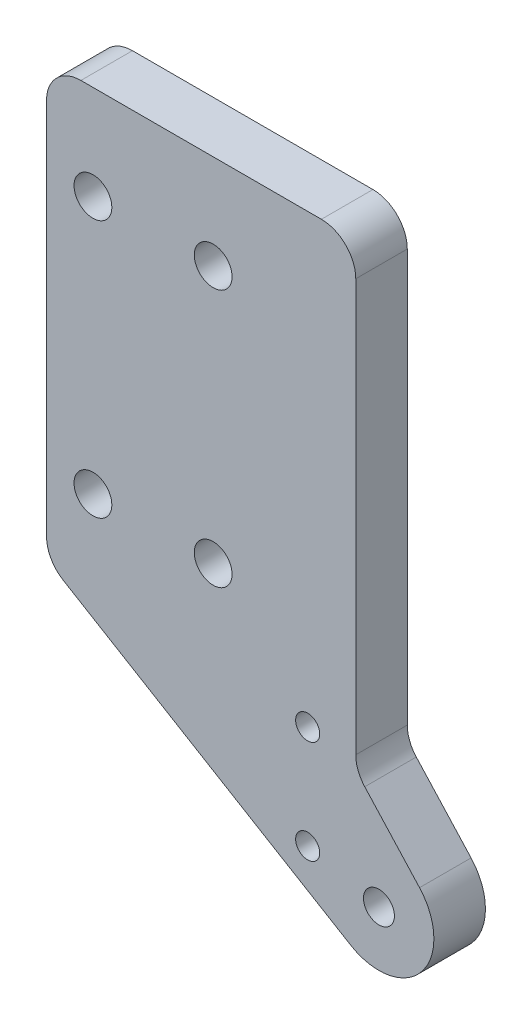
ISO-10303-21;
HEADER;
FILE_DESCRIPTION(('STEP AP214'),'2;1');
FILE_NAME('part.step','',(''),(''),'','','');
FILE_SCHEMA(('AUTOMOTIVE_DESIGN { 1 0 10303 214 1 1 1 1 }'));
ENDSEC;
DATA;
#1=APPLICATION_CONTEXT('core data for automotive mechanical design processes');
#2=APPLICATION_PROTOCOL_DEFINITION('international standard','automotive_design',2000,#1);
#3=PRODUCT_CONTEXT('',#1,'mechanical');
#4=PRODUCT('Part','Part','',(#3));
#5=PRODUCT_RELATED_PRODUCT_CATEGORY('part','',(#4));
#6=PRODUCT_DEFINITION_FORMATION('','',#4);
#7=PRODUCT_DEFINITION_CONTEXT('part definition',#1,'design');
#8=PRODUCT_DEFINITION('design','',#6,#7);
#9=PRODUCT_DEFINITION_SHAPE('','',#8);
#10=(LENGTH_UNIT() NAMED_UNIT(*) SI_UNIT(.MILLI.,.METRE.));
#11=(NAMED_UNIT(*) PLANE_ANGLE_UNIT() SI_UNIT($,.RADIAN.));
#12=(NAMED_UNIT(*) SI_UNIT($,.STERADIAN.) SOLID_ANGLE_UNIT());
#13=UNCERTAINTY_MEASURE_WITH_UNIT(LENGTH_MEASURE(1.E-05),#10,'distance_accuracy_value','');
#14=(GEOMETRIC_REPRESENTATION_CONTEXT(3) GLOBAL_UNCERTAINTY_ASSIGNED_CONTEXT((#13)) GLOBAL_UNIT_ASSIGNED_CONTEXT((#10,
#11,#12)) REPRESENTATION_CONTEXT('',''));
#15=CARTESIAN_POINT('',(0.,0.,0.));
#16=DIRECTION('',(0.,0.,1.));
#17=DIRECTION('',(1.,0.,0.));
#18=AXIS2_PLACEMENT_3D('',#15,#16,#17);
#19=CARTESIAN_POINT('',(0.,0.,5.));
#20=DIRECTION('',(0.,0.,-1.));
#21=DIRECTION('',(-1.,0.,0.));
#22=AXIS2_PLACEMENT_3D('',#19,#20,#21);
#23=CYLINDRICAL_SURFACE('',#22,29.5);
#24=CARTESIAN_POINT('',(0.,0.,2.00000000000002));
#25=DIRECTION('',(0.,0.,1.));
#26=DIRECTION('',(1.,0.,0.));
#27=AXIS2_PLACEMENT_3D('',#24,#25,#26);
#28=CIRCLE('',#27,29.5);
#29=CARTESIAN_POINT('',(29.5,0.,2.00000000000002));
#30=VERTEX_POINT('',#29);
#31=EDGE_CURVE('E43',#30,#30,#28,.T.);
#32=ORIENTED_EDGE('',*,*,#31,.T.);
#33=EDGE_LOOP('',(#32));
#34=FACE_BOUND('',#33,.T.);
#35=CARTESIAN_POINT('',(0.,0.,5.));
#36=DIRECTION('',(0.,0.,1.));
#37=DIRECTION('',(1.,0.,0.));
#38=AXIS2_PLACEMENT_3D('',#35,#36,#37);
#39=CIRCLE('',#38,29.5);
#40=CARTESIAN_POINT('',(29.5,0.,5.));
#41=VERTEX_POINT('',#40);
#42=EDGE_CURVE('E184',#41,#41,#39,.T.);
#43=ORIENTED_EDGE('',*,*,#42,.F.);
#44=EDGE_LOOP('',(#43));
#45=FACE_BOUND('',#44,.T.);
#46=ADVANCED_FACE('F34',(#34,#45),#23,.T.);
#47=CARTESIAN_POINT('',(0.,0.,0.));
#48=DIRECTION('',(0.,0.,1.));
#49=DIRECTION('',(1.,0.,0.));
#50=AXIS2_PLACEMENT_3D('',#47,#48,#49);
#51=PLANE('',#50);
#52=CARTESIAN_POINT('',(0.,0.,0.));
#53=DIRECTION('',(0.,0.,1.));
#54=DIRECTION('',(1.,0.,0.));
#55=AXIS2_PLACEMENT_3D('',#52,#53,#54);
#56=CIRCLE('',#55,27.5);
#57=CARTESIAN_POINT('',(27.5,0.,0.));
#58=VERTEX_POINT('',#57);
#59=EDGE_CURVE('E11',#58,#58,#56,.F.);
#60=ORIENTED_EDGE('',*,*,#59,.T.);
#61=EDGE_LOOP('',(#60));
#62=FACE_BOUND('',#61,.T.);
#63=ADVANCED_FACE('F206',(#62),#51,.F.);
#64=CARTESIAN_POINT('',(35.,55.,5.));
#65=DIRECTION('',(0.,0.,1.));
#66=DIRECTION('',(1.,0.,0.));
#67=AXIS2_PLACEMENT_3D('',#64,#65,#66);
#68=PLANE('',#67);
#69=CARTESIAN_POINT('',(31.,-95.,5.));
#70=DIRECTION('',(0.,0.,1.));
#71=DIRECTION('',(1.,0.,0.));
#72=AXIS2_PLACEMENT_3D('',#69,#70,#71);
#73=CIRCLE('',#72,3.5);
#74=CARTESIAN_POINT('',(34.5,-95.,5.));
#75=VERTEX_POINT('',#74);
#76=EDGE_CURVE('E277',#75,#75,#73,.F.);
#77=ORIENTED_EDGE('',*,*,#76,.F.);
#78=EDGE_LOOP('',(#77));
#79=FACE_BOUND('',#78,.T.);
#80=CARTESIAN_POINT('',(31.,-65.,5.));
#81=DIRECTION('',(0.,0.,1.));
#82=DIRECTION('',(1.,0.,0.));
#83=AXIS2_PLACEMENT_3D('',#80,#81,#82);
#84=CIRCLE('',#83,3.5);
#85=CARTESIAN_POINT('',(34.5,-65.,5.));
#86=VERTEX_POINT('',#85);
#87=EDGE_CURVE('E287',#86,#86,#84,.F.);
#88=ORIENTED_EDGE('',*,*,#87,.F.);
#89=EDGE_LOOP('',(#88));
#90=FACE_BOUND('',#89,.T.);
#91=CARTESIAN_POINT('',(51.75,-100.,5.));
#92=DIRECTION('',(0.,0.,1.));
#93=DIRECTION('',(1.,0.,0.));
#94=AXIS2_PLACEMENT_3D('',#91,#92,#93);
#95=CIRCLE('',#94,4.5);
#96=CARTESIAN_POINT('',(56.25,-100.,5.));
#97=VERTEX_POINT('',#96);
#98=EDGE_CURVE('E293',#97,#97,#95,.F.);
#99=ORIENTED_EDGE('',*,*,#98,.F.);
#100=EDGE_LOOP('',(#99));
#101=FACE_BOUND('',#100,.T.);
#102=CARTESIAN_POINT('',(3.50000000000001,37.5,5.));
#103=DIRECTION('',(0.,0.,1.));
#104=DIRECTION('',(1.,0.,0.));
#105=AXIS2_PLACEMENT_3D('',#102,#103,#104);
#106=CIRCLE('',#105,5.5);
#107=CARTESIAN_POINT('',(9.00000000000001,37.5,5.));
#108=VERTEX_POINT('',#107);
#109=EDGE_CURVE('E299',#108,#108,#106,.F.);
#110=ORIENTED_EDGE('',*,*,#109,.F.);
#111=EDGE_LOOP('',(#110));
#112=FACE_BOUND('',#111,.T.);
#113=CARTESIAN_POINT('',(3.5,-37.5,5.));
#114=DIRECTION('',(0.,0.,1.));
#115=DIRECTION('',(1.,0.,0.));
#116=AXIS2_PLACEMENT_3D('',#113,#114,#115);
#117=CIRCLE('',#116,5.5);
#118=CARTESIAN_POINT('',(9.,-37.5,5.));
#119=VERTEX_POINT('',#118);
#120=EDGE_CURVE('E305',#119,#119,#117,.F.);
#121=ORIENTED_EDGE('',*,*,#120,.F.);
#122=EDGE_LOOP('',(#121));
#123=FACE_BOUND('',#122,.T.);
#124=CARTESIAN_POINT('',(-31.5,37.5,5.));
#125=DIRECTION('',(0.,0.,1.));
#126=DIRECTION('',(1.,0.,0.));
#127=AXIS2_PLACEMENT_3D('',#124,#125,#126);
#128=CIRCLE('',#127,5.5);
#129=CARTESIAN_POINT('',(-26.,37.5,5.));
#130=VERTEX_POINT('',#129);
#131=EDGE_CURVE('E311',#130,#130,#128,.F.);
#132=ORIENTED_EDGE('',*,*,#131,.F.);
#133=EDGE_LOOP('',(#132));
#134=FACE_BOUND('',#133,.T.);
#135=CARTESIAN_POINT('',(-31.5,-37.5,5.));
#136=DIRECTION('',(0.,0.,1.));
#137=DIRECTION('',(1.,0.,0.));
#138=AXIS2_PLACEMENT_3D('',#135,#136,#137);
#139=CIRCLE('',#138,5.5);
#140=CARTESIAN_POINT('',(-26.,-37.5,5.));
#141=VERTEX_POINT('',#140);
#142=EDGE_CURVE('E148',#141,#141,#139,.F.);
#143=ORIENTED_EDGE('',*,*,#142,.F.);
#144=EDGE_LOOP('',(#143));
#145=FACE_BOUND('',#144,.T.);
#146=CARTESIAN_POINT('',(35.,55.,5.));
#147=DIRECTION('',(0.,0.,1.));
#148=DIRECTION('',(1.,0.,0.));
#149=AXIS2_PLACEMENT_3D('',#146,#147,#148);
#150=CIRCLE('',#149,10.);
#151=CARTESIAN_POINT('',(45.,55.,5.));
#152=VERTEX_POINT('',#151);
#153=CARTESIAN_POINT('',(35.,65.,5.));
#154=VERTEX_POINT('',#153);
#155=EDGE_CURVE('E144',#152,#154,#150,.T.);
#156=ORIENTED_EDGE('',*,*,#155,.F.);
#157=DIRECTION('',(0.,1.,0.));
#158=VECTOR('',#157,1.);
#159=CARTESIAN_POINT('',(45.,55.,5.));
#160=LINE('',#159,#158);
#161=CARTESIAN_POINT('',(45.,-65.,5.));
#162=VERTEX_POINT('',#161);
#163=EDGE_CURVE('E92',#162,#152,#160,.T.);
#164=ORIENTED_EDGE('',*,*,#163,.F.);
#165=CARTESIAN_POINT('',(55.,-65.,5.));
#166=DIRECTION('',(0.,0.,-1.));
#167=DIRECTION('',(-1.,0.,0.));
#168=AXIS2_PLACEMENT_3D('',#165,#166,#167);
#169=CIRCLE('',#168,9.99999999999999);
#170=CARTESIAN_POINT('',(47.6152859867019,-71.7428479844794,5.));
#171=VERTEX_POINT('',#170);
#172=EDGE_CURVE('E86',#171,#162,#169,.T.);
#173=ORIENTED_EDGE('',*,*,#172,.F.);
#174=DIRECTION('',(-0.674284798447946,0.73847140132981,0.));
#175=VECTOR('',#174,1.);
#176=CARTESIAN_POINT('',(47.6152859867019,-71.7428479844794,5.));
#177=LINE('',#176,#175);
#178=CARTESIAN_POINT('',(63.565542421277,-89.2114432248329,5.));
#179=VERTEX_POINT('',#178);
#180=EDGE_CURVE('E134',#179,#171,#177,.T.);
#181=ORIENTED_EDGE('',*,*,#180,.F.);
#182=CARTESIAN_POINT('',(51.75,-100.,5.));
#183=DIRECTION('',(0.,0.,1.));
#184=DIRECTION('',(1.,0.,0.));
#185=AXIS2_PLACEMENT_3D('',#182,#183,#184);
#186=CIRCLE('',#185,16.);
#187=CARTESIAN_POINT('',(43.5244441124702,-113.723710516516,5.));
#188=VERTEX_POINT('',#187);
#189=EDGE_CURVE('E158',#188,#179,#186,.T.);
#190=ORIENTED_EDGE('',*,*,#189,.F.);
#191=DIRECTION('',(0.857731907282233,-0.514097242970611,0.));
#192=VECTOR('',#191,1.);
#193=CARTESIAN_POINT('',(-40.1409724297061,-63.5773190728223,5.));
#194=LINE('',#193,#192);
#195=CARTESIAN_POINT('',(-40.1409724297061,-63.5773190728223,5.));
#196=VERTEX_POINT('',#195);
#197=EDGE_CURVE('E156',#196,#188,#194,.T.);
#198=ORIENTED_EDGE('',*,*,#197,.F.);
#199=CARTESIAN_POINT('',(-35.,-55.,5.));
#200=DIRECTION('',(0.,0.,1.));
#201=DIRECTION('',(-1.,0.,0.));
#202=AXIS2_PLACEMENT_3D('',#199,#200,#201);
#203=CIRCLE('',#202,10.);
#204=CARTESIAN_POINT('',(-45.,-55.,5.));
#205=VERTEX_POINT('',#204);
#206=EDGE_CURVE('E154',#205,#196,#203,.T.);
#207=ORIENTED_EDGE('',*,*,#206,.F.);
#208=DIRECTION('',(0.,-1.,0.));
#209=VECTOR('',#208,1.);
#210=CARTESIAN_POINT('',(-45.,55.,5.));
#211=LINE('',#210,#209);
#212=CARTESIAN_POINT('',(-45.,55.,5.));
#213=VERTEX_POINT('',#212);
#214=EDGE_CURVE('E152',#213,#205,#211,.T.);
#215=ORIENTED_EDGE('',*,*,#214,.F.);
#216=CARTESIAN_POINT('',(-35.,55.,5.));
#217=DIRECTION('',(0.,0.,1.));
#218=DIRECTION('',(-1.,0.,0.));
#219=AXIS2_PLACEMENT_3D('',#216,#217,#218);
#220=CIRCLE('',#219,9.99999999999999);
#221=CARTESIAN_POINT('',(-35.,65.,5.));
#222=VERTEX_POINT('',#221);
#223=EDGE_CURVE('E150',#222,#213,#220,.T.);
#224=ORIENTED_EDGE('',*,*,#223,.F.);
#225=DIRECTION('',(-1.,0.,0.));
#226=VECTOR('',#225,1.);
#227=CARTESIAN_POINT('',(-35.,65.,5.));
#228=LINE('',#227,#226);
#229=EDGE_CURVE('E147',#154,#222,#228,.T.);
#230=ORIENTED_EDGE('',*,*,#229,.F.);
#231=EDGE_LOOP('',(#156,#164,#173,#181,#190,#198,#207,#215,#224,#230));
#232=FACE_BOUND('',#231,.T.);
#233=ORIENTED_EDGE('',*,*,#42,.T.);
#234=EDGE_LOOP('',(#233));
#235=FACE_BOUND('',#234,.T.);
#236=ADVANCED_FACE('F210',(#79,#90,#101,#112,#123,#134,#145,#232,#235),#68,.F.);
#237=CARTESIAN_POINT('',(35.,55.,20.));
#238=DIRECTION('',(0.,0.,-1.));
#239=DIRECTION('',(-1.,0.,0.));
#240=AXIS2_PLACEMENT_3D('',#237,#238,#239);
#241=CYLINDRICAL_SURFACE('',#240,10.);
#242=ORIENTED_EDGE('',*,*,#155,.T.);
#243=DIRECTION('',(0.,0.,-1.));
#244=VECTOR('',#243,1.);
#245=CARTESIAN_POINT('',(35.,65.,20.));
#246=LINE('',#245,#244);
#247=CARTESIAN_POINT('',(35.,65.,20.));
#248=VERTEX_POINT('',#247);
#249=EDGE_CURVE('E182',#248,#154,#246,.T.);
#250=ORIENTED_EDGE('',*,*,#249,.F.);
#251=CARTESIAN_POINT('',(35.,55.,20.));
#252=DIRECTION('',(0.,0.,1.));
#253=DIRECTION('',(1.,0.,0.));
#254=AXIS2_PLACEMENT_3D('',#251,#252,#253);
#255=CIRCLE('',#254,10.);
#256=CARTESIAN_POINT('',(45.,55.,20.));
#257=VERTEX_POINT('',#256);
#258=EDGE_CURVE('E163',#257,#248,#255,.T.);
#259=ORIENTED_EDGE('',*,*,#258,.F.);
#260=DIRECTION('',(0.,0.,-1.));
#261=VECTOR('',#260,1.);
#262=CARTESIAN_POINT('',(45.,55.,20.));
#263=LINE('',#262,#261);
#264=EDGE_CURVE('E140',#257,#152,#263,.T.);
#265=ORIENTED_EDGE('',*,*,#264,.T.);
#266=EDGE_LOOP('',(#242,#250,#259,#265));
#267=FACE_BOUND('',#266,.T.);
#268=ADVANCED_FACE('F214',(#267),#241,.T.);
#269=CARTESIAN_POINT('',(-35.,65.,20.));
#270=DIRECTION('',(0.,-1.,0.));
#271=DIRECTION('',(1.,0.,0.));
#272=AXIS2_PLACEMENT_3D('',#269,#270,#271);
#273=PLANE('',#272);
#274=ORIENTED_EDGE('',*,*,#229,.T.);
#275=DIRECTION('',(0.,0.,-1.));
#276=VECTOR('',#275,1.);
#277=CARTESIAN_POINT('',(-35.,65.,20.));
#278=LINE('',#277,#276);
#279=CARTESIAN_POINT('',(-35.,65.,20.));
#280=VERTEX_POINT('',#279);
#281=EDGE_CURVE('E179',#280,#222,#278,.T.);
#282=ORIENTED_EDGE('',*,*,#281,.F.);
#283=DIRECTION('',(-1.,0.,0.));
#284=VECTOR('',#283,1.);
#285=CARTESIAN_POINT('',(-35.,65.,20.));
#286=LINE('',#285,#284);
#287=EDGE_CURVE('E101',#248,#280,#286,.T.);
#288=ORIENTED_EDGE('',*,*,#287,.F.);
#289=ORIENTED_EDGE('',*,*,#249,.T.);
#290=EDGE_LOOP('',(#274,#282,#288,#289));
#291=FACE_BOUND('',#290,.T.);
#292=ADVANCED_FACE('F217',(#291),#273,.F.);
#293=CARTESIAN_POINT('',(-35.,55.,20.));
#294=DIRECTION('',(0.,0.,-1.));
#295=DIRECTION('',(-1.,0.,0.));
#296=AXIS2_PLACEMENT_3D('',#293,#294,#295);
#297=CYLINDRICAL_SURFACE('',#296,9.99999999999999);
#298=ORIENTED_EDGE('',*,*,#223,.T.);
#299=DIRECTION('',(0.,0.,-1.));
#300=VECTOR('',#299,1.);
#301=CARTESIAN_POINT('',(-45.,55.,20.));
#302=LINE('',#301,#300);
#303=CARTESIAN_POINT('',(-45.,55.,20.));
#304=VERTEX_POINT('',#303);
#305=EDGE_CURVE('E176',#304,#213,#302,.T.);
#306=ORIENTED_EDGE('',*,*,#305,.F.);
#307=CARTESIAN_POINT('',(-35.,55.,20.));
#308=DIRECTION('',(0.,0.,1.));
#309=DIRECTION('',(-1.,0.,0.));
#310=AXIS2_PLACEMENT_3D('',#307,#308,#309);
#311=CIRCLE('',#310,9.99999999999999);
#312=EDGE_CURVE('E321',#280,#304,#311,.T.);
#313=ORIENTED_EDGE('',*,*,#312,.F.);
#314=ORIENTED_EDGE('',*,*,#281,.T.);
#315=EDGE_LOOP('',(#298,#306,#313,#314));
#316=FACE_BOUND('',#315,.T.);
#317=ADVANCED_FACE('F221',(#316),#297,.T.);
#318=CARTESIAN_POINT('',(-45.,55.,20.));
#319=DIRECTION('',(1.,0.,0.));
#320=DIRECTION('',(0.,0.,-1.));
#321=AXIS2_PLACEMENT_3D('',#318,#319,#320);
#322=PLANE('',#321);
#323=ORIENTED_EDGE('',*,*,#214,.T.);
#324=DIRECTION('',(0.,0.,-1.));
#325=VECTOR('',#324,1.);
#326=CARTESIAN_POINT('',(-45.,-55.,20.));
#327=LINE('',#326,#325);
#328=CARTESIAN_POINT('',(-45.,-55.,20.));
#329=VERTEX_POINT('',#328);
#330=EDGE_CURVE('E173',#329,#205,#327,.T.);
#331=ORIENTED_EDGE('',*,*,#330,.F.);
#332=DIRECTION('',(0.,-1.,0.));
#333=VECTOR('',#332,1.);
#334=CARTESIAN_POINT('',(-45.,55.,20.));
#335=LINE('',#334,#333);
#336=EDGE_CURVE('E323',#304,#329,#335,.T.);
#337=ORIENTED_EDGE('',*,*,#336,.F.);
#338=ORIENTED_EDGE('',*,*,#305,.T.);
#339=EDGE_LOOP('',(#323,#331,#337,#338));
#340=FACE_BOUND('',#339,.T.);
#341=ADVANCED_FACE('F224',(#340),#322,.F.);
#342=CARTESIAN_POINT('',(-35.,-55.,20.));
#343=DIRECTION('',(0.,0.,-1.));
#344=DIRECTION('',(-1.,0.,0.));
#345=AXIS2_PLACEMENT_3D('',#342,#343,#344);
#346=CYLINDRICAL_SURFACE('',#345,10.);
#347=ORIENTED_EDGE('',*,*,#206,.T.);
#348=DIRECTION('',(0.,0.,-1.));
#349=VECTOR('',#348,1.);
#350=CARTESIAN_POINT('',(-40.1409724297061,-63.5773190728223,20.));
#351=LINE('',#350,#349);
#352=CARTESIAN_POINT('',(-40.1409724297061,-63.5773190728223,20.));
#353=VERTEX_POINT('',#352);
#354=EDGE_CURVE('E170',#353,#196,#351,.T.);
#355=ORIENTED_EDGE('',*,*,#354,.F.);
#356=CARTESIAN_POINT('',(-35.,-55.,20.));
#357=DIRECTION('',(0.,0.,1.));
#358=DIRECTION('',(-1.,0.,0.));
#359=AXIS2_PLACEMENT_3D('',#356,#357,#358);
#360=CIRCLE('',#359,10.);
#361=EDGE_CURVE('E325',#329,#353,#360,.T.);
#362=ORIENTED_EDGE('',*,*,#361,.F.);
#363=ORIENTED_EDGE('',*,*,#330,.T.);
#364=EDGE_LOOP('',(#347,#355,#362,#363));
#365=FACE_BOUND('',#364,.T.);
#366=ADVANCED_FACE('F228',(#365),#346,.T.);
#367=CARTESIAN_POINT('',(-40.1409724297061,-63.5773190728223,20.));
#368=DIRECTION('',(0.514097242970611,0.857731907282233,0.));
#369=DIRECTION('',(-0.857731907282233,0.514097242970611,0.));
#370=AXIS2_PLACEMENT_3D('',#367,#368,#369);
#371=PLANE('',#370);
#372=ORIENTED_EDGE('',*,*,#197,.T.);
#373=DIRECTION('',(0.,0.,-1.));
#374=VECTOR('',#373,1.);
#375=CARTESIAN_POINT('',(43.5244441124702,-113.723710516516,20.));
#376=LINE('',#375,#374);
#377=CARTESIAN_POINT('',(43.5244441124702,-113.723710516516,20.));
#378=VERTEX_POINT('',#377);
#379=EDGE_CURVE('E167',#378,#188,#376,.T.);
#380=ORIENTED_EDGE('',*,*,#379,.F.);
#381=DIRECTION('',(0.857731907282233,-0.514097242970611,0.));
#382=VECTOR('',#381,1.);
#383=CARTESIAN_POINT('',(-40.1409724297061,-63.5773190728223,20.));
#384=LINE('',#383,#382);
#385=EDGE_CURVE('E327',#353,#378,#384,.T.);
#386=ORIENTED_EDGE('',*,*,#385,.F.);
#387=ORIENTED_EDGE('',*,*,#354,.T.);
#388=EDGE_LOOP('',(#372,#380,#386,#387));
#389=FACE_BOUND('',#388,.T.);
#390=ADVANCED_FACE('F232',(#389),#371,.F.);
#391=CARTESIAN_POINT('',(51.75,-100.,20.));
#392=DIRECTION('',(0.,0.,-1.));
#393=DIRECTION('',(-1.,0.,0.));
#394=AXIS2_PLACEMENT_3D('',#391,#392,#393);
#395=CYLINDRICAL_SURFACE('',#394,16.);
#396=ORIENTED_EDGE('',*,*,#189,.T.);
#397=DIRECTION('',(0.,0.,-1.));
#398=VECTOR('',#397,1.);
#399=CARTESIAN_POINT('',(63.565542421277,-89.2114432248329,20.));
#400=LINE('',#399,#398);
#401=CARTESIAN_POINT('',(63.565542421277,-89.2114432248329,20.));
#402=VERTEX_POINT('',#401);
#403=EDGE_CURVE('E135',#402,#179,#400,.T.);
#404=ORIENTED_EDGE('',*,*,#403,.F.);
#405=CARTESIAN_POINT('',(51.75,-100.,20.));
#406=DIRECTION('',(0.,0.,1.));
#407=DIRECTION('',(1.,0.,0.));
#408=AXIS2_PLACEMENT_3D('',#405,#406,#407);
#409=CIRCLE('',#408,16.);
#410=EDGE_CURVE('E126',#378,#402,#409,.T.);
#411=ORIENTED_EDGE('',*,*,#410,.F.);
#412=ORIENTED_EDGE('',*,*,#379,.T.);
#413=EDGE_LOOP('',(#396,#404,#411,#412));
#414=FACE_BOUND('',#413,.T.);
#415=ADVANCED_FACE('F236',(#414),#395,.T.);
#416=CARTESIAN_POINT('',(47.6152859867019,-71.7428479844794,20.));
#417=DIRECTION('',(-0.73847140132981,-0.674284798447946,0.));
#418=DIRECTION('',(0.674284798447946,-0.73847140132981,0.));
#419=AXIS2_PLACEMENT_3D('',#416,#417,#418);
#420=PLANE('',#419);
#421=ORIENTED_EDGE('',*,*,#180,.T.);
#422=DIRECTION('',(0.,0.,-1.));
#423=VECTOR('',#422,1.);
#424=CARTESIAN_POINT('',(47.6152859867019,-71.7428479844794,20.));
#425=LINE('',#424,#423);
#426=CARTESIAN_POINT('',(47.6152859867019,-71.7428479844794,20.));
#427=VERTEX_POINT('',#426);
#428=EDGE_CURVE('E131',#427,#171,#425,.T.);
#429=ORIENTED_EDGE('',*,*,#428,.F.);
#430=DIRECTION('',(-0.674284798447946,0.73847140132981,0.));
#431=VECTOR('',#430,1.);
#432=CARTESIAN_POINT('',(47.6152859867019,-71.7428479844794,20.));
#433=LINE('',#432,#431);
#434=EDGE_CURVE('E120',#402,#427,#433,.T.);
#435=ORIENTED_EDGE('',*,*,#434,.F.);
#436=ORIENTED_EDGE('',*,*,#403,.T.);
#437=EDGE_LOOP('',(#421,#429,#435,#436));
#438=FACE_BOUND('',#437,.T.);
#439=ADVANCED_FACE('F132',(#438),#420,.F.);
#440=CARTESIAN_POINT('',(55.,-65.,20.));
#441=DIRECTION('',(0.,0.,-1.));
#442=DIRECTION('',(-1.,0.,0.));
#443=AXIS2_PLACEMENT_3D('',#440,#441,#442);
#444=CYLINDRICAL_SURFACE('',#443,9.99999999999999);
#445=ORIENTED_EDGE('',*,*,#172,.T.);
#446=DIRECTION('',(0.,0.,-1.));
#447=VECTOR('',#446,1.);
#448=CARTESIAN_POINT('',(45.,-65.,20.));
#449=LINE('',#448,#447);
#450=CARTESIAN_POINT('',(45.,-65.,20.));
#451=VERTEX_POINT('',#450);
#452=EDGE_CURVE('E136',#451,#162,#449,.T.);
#453=ORIENTED_EDGE('',*,*,#452,.F.);
#454=CARTESIAN_POINT('',(55.,-65.,20.));
#455=DIRECTION('',(0.,0.,-1.));
#456=DIRECTION('',(-1.,0.,0.));
#457=AXIS2_PLACEMENT_3D('',#454,#455,#456);
#458=CIRCLE('',#457,9.99999999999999);
#459=EDGE_CURVE('E124',#427,#451,#458,.T.);
#460=ORIENTED_EDGE('',*,*,#459,.F.);
#461=ORIENTED_EDGE('',*,*,#428,.T.);
#462=EDGE_LOOP('',(#445,#453,#460,#461));
#463=FACE_BOUND('',#462,.T.);
#464=ADVANCED_FACE('F138',(#463),#444,.F.);
#465=CARTESIAN_POINT('',(45.,55.,20.));
#466=DIRECTION('',(-1.,0.,0.));
#467=DIRECTION('',(0.,-1.,0.));
#468=AXIS2_PLACEMENT_3D('',#465,#466,#467);
#469=PLANE('',#468);
#470=ORIENTED_EDGE('',*,*,#163,.T.);
#471=ORIENTED_EDGE('',*,*,#264,.F.);
#472=DIRECTION('',(0.,1.,0.));
#473=VECTOR('',#472,1.);
#474=CARTESIAN_POINT('',(45.,55.,20.));
#475=LINE('',#474,#473);
#476=EDGE_CURVE('E51',#451,#257,#475,.T.);
#477=ORIENTED_EDGE('',*,*,#476,.F.);
#478=ORIENTED_EDGE('',*,*,#452,.T.);
#479=EDGE_LOOP('',(#470,#471,#477,#478));
#480=FACE_BOUND('',#479,.T.);
#481=ADVANCED_FACE('F201',(#480),#469,.F.);
#482=CARTESIAN_POINT('',(35.,55.,20.));
#483=DIRECTION('',(0.,0.,1.));
#484=DIRECTION('',(1.,0.,0.));
#485=AXIS2_PLACEMENT_3D('',#482,#483,#484);
#486=PLANE('',#485);
#487=CARTESIAN_POINT('',(31.,-95.,20.));
#488=DIRECTION('',(0.,0.,1.));
#489=DIRECTION('',(1.,0.,0.));
#490=AXIS2_PLACEMENT_3D('',#487,#488,#489);
#491=CIRCLE('',#490,3.5);
#492=CARTESIAN_POINT('',(34.5,-95.,20.));
#493=VERTEX_POINT('',#492);
#494=EDGE_CURVE('E280',#493,#493,#491,.T.);
#495=ORIENTED_EDGE('',*,*,#494,.F.);
#496=EDGE_LOOP('',(#495));
#497=FACE_BOUND('',#496,.T.);
#498=CARTESIAN_POINT('',(31.,-65.,20.));
#499=DIRECTION('',(0.,0.,1.));
#500=DIRECTION('',(1.,0.,0.));
#501=AXIS2_PLACEMENT_3D('',#498,#499,#500);
#502=CIRCLE('',#501,3.5);
#503=CARTESIAN_POINT('',(34.5,-65.,20.));
#504=VERTEX_POINT('',#503);
#505=EDGE_CURVE('E282',#504,#504,#502,.T.);
#506=ORIENTED_EDGE('',*,*,#505,.F.);
#507=EDGE_LOOP('',(#506));
#508=FACE_BOUND('',#507,.T.);
#509=CARTESIAN_POINT('',(51.75,-100.,20.));
#510=DIRECTION('',(0.,0.,1.));
#511=DIRECTION('',(1.,0.,0.));
#512=AXIS2_PLACEMENT_3D('',#509,#510,#511);
#513=CIRCLE('',#512,4.5);
#514=CARTESIAN_POINT('',(56.25,-100.,20.));
#515=VERTEX_POINT('',#514);
#516=EDGE_CURVE('E290',#515,#515,#513,.T.);
#517=ORIENTED_EDGE('',*,*,#516,.F.);
#518=EDGE_LOOP('',(#517));
#519=FACE_BOUND('',#518,.T.);
#520=CARTESIAN_POINT('',(3.50000000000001,37.5,20.));
#521=DIRECTION('',(0.,0.,1.));
#522=DIRECTION('',(1.,0.,0.));
#523=AXIS2_PLACEMENT_3D('',#520,#521,#522);
#524=CIRCLE('',#523,5.5);
#525=CARTESIAN_POINT('',(9.00000000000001,37.5,20.));
#526=VERTEX_POINT('',#525);
#527=EDGE_CURVE('E296',#526,#526,#524,.T.);
#528=ORIENTED_EDGE('',*,*,#527,.F.);
#529=EDGE_LOOP('',(#528));
#530=FACE_BOUND('',#529,.T.);
#531=CARTESIAN_POINT('',(3.5,-37.5,20.));
#532=DIRECTION('',(0.,0.,1.));
#533=DIRECTION('',(1.,0.,0.));
#534=AXIS2_PLACEMENT_3D('',#531,#532,#533);
#535=CIRCLE('',#534,5.5);
#536=CARTESIAN_POINT('',(9.,-37.5,20.));
#537=VERTEX_POINT('',#536);
#538=EDGE_CURVE('E302',#537,#537,#535,.T.);
#539=ORIENTED_EDGE('',*,*,#538,.F.);
#540=EDGE_LOOP('',(#539));
#541=FACE_BOUND('',#540,.T.);
#542=CARTESIAN_POINT('',(-31.5,37.5,20.));
#543=DIRECTION('',(0.,0.,1.));
#544=DIRECTION('',(1.,0.,0.));
#545=AXIS2_PLACEMENT_3D('',#542,#543,#544);
#546=CIRCLE('',#545,5.5);
#547=CARTESIAN_POINT('',(-26.,37.5,20.));
#548=VERTEX_POINT('',#547);
#549=EDGE_CURVE('E308',#548,#548,#546,.T.);
#550=ORIENTED_EDGE('',*,*,#549,.F.);
#551=EDGE_LOOP('',(#550));
#552=FACE_BOUND('',#551,.T.);
#553=CARTESIAN_POINT('',(-31.5,-37.5,20.));
#554=DIRECTION('',(0.,0.,1.));
#555=DIRECTION('',(1.,0.,0.));
#556=AXIS2_PLACEMENT_3D('',#553,#554,#555);
#557=CIRCLE('',#556,5.5);
#558=CARTESIAN_POINT('',(-26.,-37.5,20.));
#559=VERTEX_POINT('',#558);
#560=EDGE_CURVE('E314',#559,#559,#557,.T.);
#561=ORIENTED_EDGE('',*,*,#560,.F.);
#562=EDGE_LOOP('',(#561));
#563=FACE_BOUND('',#562,.T.);
#564=ORIENTED_EDGE('',*,*,#258,.T.);
#565=ORIENTED_EDGE('',*,*,#287,.T.);
#566=ORIENTED_EDGE('',*,*,#312,.T.);
#567=ORIENTED_EDGE('',*,*,#336,.T.);
#568=ORIENTED_EDGE('',*,*,#361,.T.);
#569=ORIENTED_EDGE('',*,*,#385,.T.);
#570=ORIENTED_EDGE('',*,*,#410,.T.);
#571=ORIENTED_EDGE('',*,*,#434,.T.);
#572=ORIENTED_EDGE('',*,*,#459,.T.);
#573=ORIENTED_EDGE('',*,*,#476,.T.);
#574=EDGE_LOOP('',(#564,#565,#566,#567,#568,#569,#570,#571,#572,#573));
#575=FACE_BOUND('',#574,.T.);
#576=ADVANCED_FACE('F122',(#497,#508,#519,#530,#541,#552,#563,#575),#486,.T.);
#577=CARTESIAN_POINT('',(0.,0.,2.00000000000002));
#578=DIRECTION('',(0.,0.,1.));
#579=DIRECTION('',(1.,0.,0.));
#580=AXIS2_PLACEMENT_3D('',#577,#578,#579);
#581=CONICAL_SURFACE('',#580,29.5,0.785398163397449);
#582=ORIENTED_EDGE('',*,*,#59,.F.);
#583=EDGE_LOOP('',(#582));
#584=FACE_BOUND('',#583,.T.);
#585=ORIENTED_EDGE('',*,*,#31,.F.);
#586=EDGE_LOOP('',(#585));
#587=FACE_BOUND('',#586,.T.);
#588=ADVANCED_FACE('F36',(#584,#587),#581,.T.);
#589=CARTESIAN_POINT('',(-31.5,-37.5,-10.556349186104));
#590=DIRECTION('',(0.,0.,1.));
#591=DIRECTION('',(1.,0.,0.));
#592=AXIS2_PLACEMENT_3D('',#589,#590,#591);
#593=CYLINDRICAL_SURFACE('',#592,5.5);
#594=ORIENTED_EDGE('',*,*,#142,.T.);
#595=EDGE_LOOP('',(#594));
#596=FACE_BOUND('',#595,.T.);
#597=ORIENTED_EDGE('',*,*,#560,.T.);
#598=EDGE_LOOP('',(#597));
#599=FACE_BOUND('',#598,.T.);
#600=ADVANCED_FACE('F192',(#596,#599),#593,.F.);
#601=CARTESIAN_POINT('',(-31.5,37.5,-10.556349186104));
#602=DIRECTION('',(0.,0.,1.));
#603=DIRECTION('',(1.,0.,0.));
#604=AXIS2_PLACEMENT_3D('',#601,#602,#603);
#605=CYLINDRICAL_SURFACE('',#604,5.5);
#606=ORIENTED_EDGE('',*,*,#131,.T.);
#607=EDGE_LOOP('',(#606));
#608=FACE_BOUND('',#607,.T.);
#609=ORIENTED_EDGE('',*,*,#549,.T.);
#610=EDGE_LOOP('',(#609));
#611=FACE_BOUND('',#610,.T.);
#612=ADVANCED_FACE('F198',(#608,#611),#605,.F.);
#613=CARTESIAN_POINT('',(3.5,-37.5,-10.556349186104));
#614=DIRECTION('',(0.,0.,1.));
#615=DIRECTION('',(1.,0.,0.));
#616=AXIS2_PLACEMENT_3D('',#613,#614,#615);
#617=CYLINDRICAL_SURFACE('',#616,5.5);
#618=ORIENTED_EDGE('',*,*,#120,.T.);
#619=EDGE_LOOP('',(#618));
#620=FACE_BOUND('',#619,.T.);
#621=ORIENTED_EDGE('',*,*,#538,.T.);
#622=EDGE_LOOP('',(#621));
#623=FACE_BOUND('',#622,.T.);
#624=ADVANCED_FACE('F252',(#620,#623),#617,.F.);
#625=CARTESIAN_POINT('',(3.50000000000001,37.5,-10.556349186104));
#626=DIRECTION('',(0.,0.,1.));
#627=DIRECTION('',(1.,0.,0.));
#628=AXIS2_PLACEMENT_3D('',#625,#626,#627);
#629=CYLINDRICAL_SURFACE('',#628,5.5);
#630=ORIENTED_EDGE('',*,*,#109,.T.);
#631=EDGE_LOOP('',(#630));
#632=FACE_BOUND('',#631,.T.);
#633=ORIENTED_EDGE('',*,*,#527,.T.);
#634=EDGE_LOOP('',(#633));
#635=FACE_BOUND('',#634,.T.);
#636=ADVANCED_FACE('F256',(#632,#635),#629,.F.);
#637=CARTESIAN_POINT('',(51.75,-100.,-7.72792206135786));
#638=DIRECTION('',(0.,0.,1.));
#639=DIRECTION('',(1.,0.,0.));
#640=AXIS2_PLACEMENT_3D('',#637,#638,#639);
#641=CYLINDRICAL_SURFACE('',#640,4.5);
#642=ORIENTED_EDGE('',*,*,#98,.T.);
#643=EDGE_LOOP('',(#642));
#644=FACE_BOUND('',#643,.T.);
#645=ORIENTED_EDGE('',*,*,#516,.T.);
#646=EDGE_LOOP('',(#645));
#647=FACE_BOUND('',#646,.T.);
#648=ADVANCED_FACE('F260',(#644,#647),#641,.F.);
#649=CARTESIAN_POINT('',(31.,-65.,-4.89949493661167));
#650=DIRECTION('',(0.,0.,1.));
#651=DIRECTION('',(1.,0.,0.));
#652=AXIS2_PLACEMENT_3D('',#649,#650,#651);
#653=CYLINDRICAL_SURFACE('',#652,3.5);
#654=ORIENTED_EDGE('',*,*,#87,.T.);
#655=EDGE_LOOP('',(#654));
#656=FACE_BOUND('',#655,.T.);
#657=ORIENTED_EDGE('',*,*,#505,.T.);
#658=EDGE_LOOP('',(#657));
#659=FACE_BOUND('',#658,.T.);
#660=ADVANCED_FACE('F264',(#656,#659),#653,.F.);
#661=CARTESIAN_POINT('',(31.,-95.,-4.89949493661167));
#662=DIRECTION('',(0.,0.,1.));
#663=DIRECTION('',(1.,0.,0.));
#664=AXIS2_PLACEMENT_3D('',#661,#662,#663);
#665=CYLINDRICAL_SURFACE('',#664,3.5);
#666=ORIENTED_EDGE('',*,*,#76,.T.);
#667=EDGE_LOOP('',(#666));
#668=FACE_BOUND('',#667,.T.);
#669=ORIENTED_EDGE('',*,*,#494,.T.);
#670=EDGE_LOOP('',(#669));
#671=FACE_BOUND('',#670,.T.);
#672=ADVANCED_FACE('F268',(#668,#671),#665,.F.);
#673=CLOSED_SHELL('',(#46,#63,#236,#268,#292,#317,#341,#366,#390,#415,#439,#464,#481,#576,#588,
#600,#612,#624,#636,#648,#660,#672));
#674=MANIFOLD_SOLID_BREP('B2',#673);
#675=ADVANCED_BREP_SHAPE_REPRESENTATION('',(#18,#674),#14);
#676=SHAPE_DEFINITION_REPRESENTATION(#9,#675);
ENDSEC;
END-ISO-10303-21;
